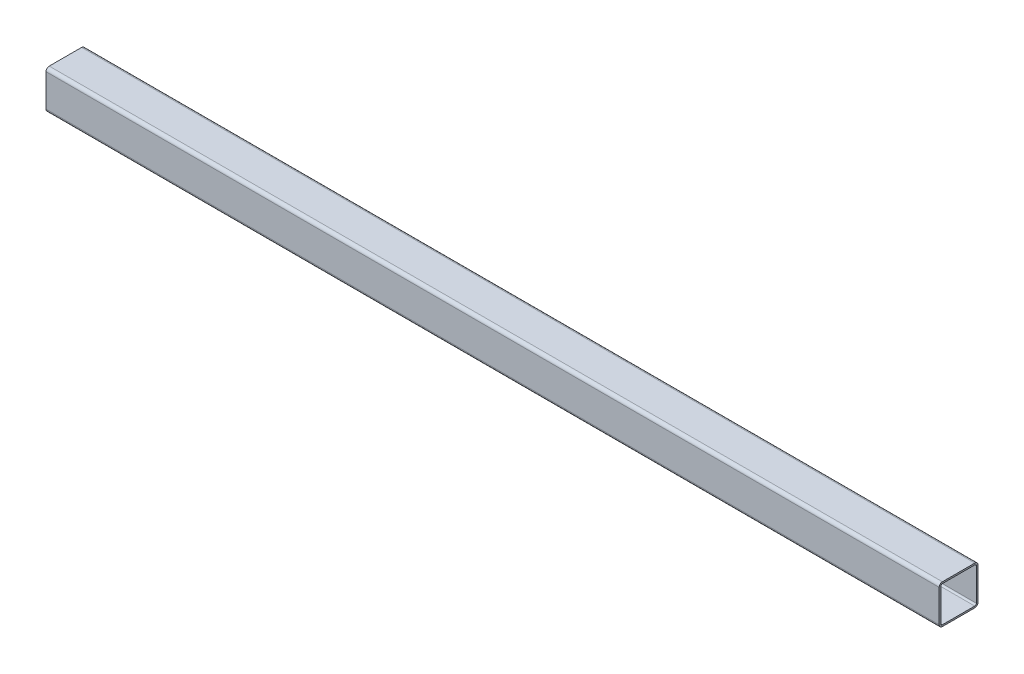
ISO-10303-21;
HEADER;
FILE_DESCRIPTION(('STEP AP214'),'2;1');
FILE_NAME('part.step','',(''),(''),'','','');
FILE_SCHEMA(('AUTOMOTIVE_DESIGN { 1 0 10303 214 1 1 1 1 }'));
ENDSEC;
DATA;
#1=APPLICATION_CONTEXT('core data for automotive mechanical design processes');
#2=APPLICATION_PROTOCOL_DEFINITION('international standard','automotive_design',2000,#1);
#3=PRODUCT_CONTEXT('',#1,'mechanical');
#4=PRODUCT('Part','Part','',(#3));
#5=PRODUCT_RELATED_PRODUCT_CATEGORY('part','',(#4));
#6=PRODUCT_DEFINITION_FORMATION('','',#4);
#7=PRODUCT_DEFINITION_CONTEXT('part definition',#1,'design');
#8=PRODUCT_DEFINITION('design','',#6,#7);
#9=PRODUCT_DEFINITION_SHAPE('','',#8);
#10=(LENGTH_UNIT() NAMED_UNIT(*) SI_UNIT(.MILLI.,.METRE.));
#11=(NAMED_UNIT(*) PLANE_ANGLE_UNIT() SI_UNIT($,.RADIAN.));
#12=(NAMED_UNIT(*) SI_UNIT($,.STERADIAN.) SOLID_ANGLE_UNIT());
#13=UNCERTAINTY_MEASURE_WITH_UNIT(LENGTH_MEASURE(1.E-05),#10,'distance_accuracy_value','');
#14=(GEOMETRIC_REPRESENTATION_CONTEXT(3) GLOBAL_UNCERTAINTY_ASSIGNED_CONTEXT((#13)) GLOBAL_UNIT_ASSIGNED_CONTEXT((#10,
#11,#12)) REPRESENTATION_CONTEXT('',''));
#15=CARTESIAN_POINT('',(0.,0.,0.));
#16=DIRECTION('',(0.,0.,1.));
#17=DIRECTION('',(1.,0.,0.));
#18=AXIS2_PLACEMENT_3D('',#15,#16,#17);
#19=CARTESIAN_POINT('',(0.,63.4999999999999,63.4999999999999));
#20=DIRECTION('',(1.,0.,0.));
#21=DIRECTION('',(0.,0.,-1.));
#22=AXIS2_PLACEMENT_3D('',#19,#20,#21);
#23=PLANE('',#22);
#24=CARTESIAN_POINT('',(0.,63.4999999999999,63.4999999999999));
#25=DIRECTION('',(1.,0.,0.));
#26=DIRECTION('',(0.,0.,-1.));
#27=AXIS2_PLACEMENT_3D('',#24,#25,#26);
#28=CIRCLE('',#27,12.7);
#29=CARTESIAN_POINT('',(0.,76.2,63.4999999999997));
#30=VERTEX_POINT('',#29);
#31=CARTESIAN_POINT('',(0.,63.4999999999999,76.2));
#32=VERTEX_POINT('',#31);
#33=EDGE_CURVE('E185',#30,#32,#28,.T.);
#34=ORIENTED_EDGE('',*,*,#33,.F.);
#35=DIRECTION('',(0.,0.,1.));
#36=VECTOR('',#35,1.);
#37=CARTESIAN_POINT('',(0.,76.2,63.4999999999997));
#38=LINE('',#37,#36);
#39=CARTESIAN_POINT('',(-4.44089209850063E-13,76.2,-63.5000000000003));
#40=VERTEX_POINT('',#39);
#41=EDGE_CURVE('E210',#40,#30,#38,.T.);
#42=ORIENTED_EDGE('',*,*,#41,.F.);
#43=CARTESIAN_POINT('',(-4.44089209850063E-13,63.4999999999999,-63.5000000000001));
#44=DIRECTION('',(1.,0.,0.));
#45=DIRECTION('',(0.,0.,-1.));
#46=AXIS2_PLACEMENT_3D('',#43,#44,#45);
#47=CIRCLE('',#46,12.7);
#48=CARTESIAN_POINT('',(-4.44089209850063E-13,63.4999999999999,-76.2));
#49=VERTEX_POINT('',#48);
#50=EDGE_CURVE('E214',#49,#40,#47,.T.);
#51=ORIENTED_EDGE('',*,*,#50,.F.);
#52=DIRECTION('',(0.,1.,0.));
#53=VECTOR('',#52,1.);
#54=CARTESIAN_POINT('',(-4.44089209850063E-13,-63.4999999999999,-76.2));
#55=LINE('',#54,#53);
#56=CARTESIAN_POINT('',(-4.44089209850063E-13,-63.4999999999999,-76.2));
#57=VERTEX_POINT('',#56);
#58=EDGE_CURVE('E218',#57,#49,#55,.T.);
#59=ORIENTED_EDGE('',*,*,#58,.F.);
#60=CARTESIAN_POINT('',(-4.44089209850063E-13,-63.4999999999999,-63.4999999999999));
#61=DIRECTION('',(1.,0.,0.));
#62=DIRECTION('',(0.,0.,-1.));
#63=AXIS2_PLACEMENT_3D('',#60,#61,#62);
#64=CIRCLE('',#63,12.7);
#65=CARTESIAN_POINT('',(-4.44089209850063E-13,-76.2,-63.4999999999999));
#66=VERTEX_POINT('',#65);
#67=EDGE_CURVE('E222',#66,#57,#64,.T.);
#68=ORIENTED_EDGE('',*,*,#67,.F.);
#69=DIRECTION('',(0.,0.,-1.));
#70=VECTOR('',#69,1.);
#71=CARTESIAN_POINT('',(-4.44089209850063E-13,-76.2,-63.4999999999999));
#72=LINE('',#71,#70);
#73=CARTESIAN_POINT('',(0.,-76.2,63.5000000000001));
#74=VERTEX_POINT('',#73);
#75=EDGE_CURVE('E226',#74,#66,#72,.T.);
#76=ORIENTED_EDGE('',*,*,#75,.F.);
#77=CARTESIAN_POINT('',(0.,-63.4999999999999,63.5000000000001));
#78=DIRECTION('',(1.,0.,0.));
#79=DIRECTION('',(0.,0.,-1.));
#80=AXIS2_PLACEMENT_3D('',#77,#78,#79);
#81=CIRCLE('',#80,12.7);
#82=CARTESIAN_POINT('',(0.,-63.4999999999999,76.2));
#83=VERTEX_POINT('',#82);
#84=EDGE_CURVE('E230',#83,#74,#81,.T.);
#85=ORIENTED_EDGE('',*,*,#84,.F.);
#86=DIRECTION('',(0.,-1.,0.));
#87=VECTOR('',#86,1.);
#88=CARTESIAN_POINT('',(0.,63.4999999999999,76.2));
#89=LINE('',#88,#87);
#90=EDGE_CURVE('E234',#32,#83,#89,.T.);
#91=ORIENTED_EDGE('',*,*,#90,.F.);
#92=EDGE_LOOP('',(#34,#42,#51,#59,#68,#76,#85,#91));
#93=FACE_BOUND('',#92,.T.);
#94=CARTESIAN_POINT('',(0.,63.4999999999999,63.4999999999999));
#95=DIRECTION('',(1.,0.,0.));
#96=DIRECTION('',(0.,0.,-1.));
#97=AXIS2_PLACEMENT_3D('',#94,#95,#96);
#98=CIRCLE('',#97,6.35000000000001);
#99=CARTESIAN_POINT('',(0.,69.8500000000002,63.4999999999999));
#100=VERTEX_POINT('',#99);
#101=CARTESIAN_POINT('',(0.,63.4999999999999,69.85));
#102=VERTEX_POINT('',#101);
#103=EDGE_CURVE('E291',#100,#102,#98,.T.);
#104=ORIENTED_EDGE('',*,*,#103,.T.);
#105=DIRECTION('',(0.,-1.,0.));
#106=VECTOR('',#105,1.);
#107=CARTESIAN_POINT('',(0.,63.4999999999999,69.85));
#108=LINE('',#107,#106);
#109=CARTESIAN_POINT('',(0.,-63.4999999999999,69.85));
#110=VERTEX_POINT('',#109);
#111=EDGE_CURVE('E287',#102,#110,#108,.T.);
#112=ORIENTED_EDGE('',*,*,#111,.T.);
#113=CARTESIAN_POINT('',(0.,-63.4999999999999,63.5000000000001));
#114=DIRECTION('',(1.,0.,0.));
#115=DIRECTION('',(0.,0.,-1.));
#116=AXIS2_PLACEMENT_3D('',#113,#114,#115);
#117=CIRCLE('',#116,6.34999999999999);
#118=CARTESIAN_POINT('',(0.,-69.8499999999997,63.5000000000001));
#119=VERTEX_POINT('',#118);
#120=EDGE_CURVE('E283',#110,#119,#117,.T.);
#121=ORIENTED_EDGE('',*,*,#120,.T.);
#122=DIRECTION('',(0.,0.,-1.));
#123=VECTOR('',#122,1.);
#124=CARTESIAN_POINT('',(-4.44089209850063E-13,-69.8500000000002,-63.4999999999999));
#125=LINE('',#124,#123);
#126=CARTESIAN_POINT('',(-4.44089209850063E-13,-69.8500000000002,-63.4999999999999));
#127=VERTEX_POINT('',#126);
#128=EDGE_CURVE('E279',#119,#127,#125,.T.);
#129=ORIENTED_EDGE('',*,*,#128,.T.);
#130=CARTESIAN_POINT('',(-4.44089209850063E-13,-63.4999999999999,-63.4999999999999));
#131=DIRECTION('',(1.,0.,0.));
#132=DIRECTION('',(0.,0.,-1.));
#133=AXIS2_PLACEMENT_3D('',#130,#131,#132);
#134=CIRCLE('',#133,6.35);
#135=CARTESIAN_POINT('',(-4.44089209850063E-13,-63.4999999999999,-69.85));
#136=VERTEX_POINT('',#135);
#137=EDGE_CURVE('E275',#127,#136,#134,.T.);
#138=ORIENTED_EDGE('',*,*,#137,.T.);
#139=DIRECTION('',(0.,1.,0.));
#140=VECTOR('',#139,1.);
#141=CARTESIAN_POINT('',(-4.44089209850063E-13,-63.4999999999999,-69.85));
#142=LINE('',#141,#140);
#143=CARTESIAN_POINT('',(-4.44089209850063E-13,63.4999999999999,-69.85));
#144=VERTEX_POINT('',#143);
#145=EDGE_CURVE('E271',#136,#144,#142,.T.);
#146=ORIENTED_EDGE('',*,*,#145,.T.);
#147=CARTESIAN_POINT('',(-4.44089209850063E-13,63.4999999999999,-63.5000000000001));
#148=DIRECTION('',(1.,0.,0.));
#149=DIRECTION('',(0.,0.,-1.));
#150=AXIS2_PLACEMENT_3D('',#147,#148,#149);
#151=CIRCLE('',#150,6.34999999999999);
#152=CARTESIAN_POINT('',(-4.44089209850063E-13,69.8500000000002,-63.5000000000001));
#153=VERTEX_POINT('',#152);
#154=EDGE_CURVE('E267',#144,#153,#151,.T.);
#155=ORIENTED_EDGE('',*,*,#154,.T.);
#156=DIRECTION('',(0.,0.,1.));
#157=VECTOR('',#156,1.);
#158=CARTESIAN_POINT('',(0.,69.8500000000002,63.4999999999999));
#159=LINE('',#158,#157);
#160=EDGE_CURVE('E263',#153,#100,#159,.T.);
#161=ORIENTED_EDGE('',*,*,#160,.T.);
#162=EDGE_LOOP('',(#104,#112,#121,#129,#138,#146,#155,#161));
#163=FACE_BOUND('',#162,.T.);
#164=ADVANCED_FACE('F51',(#93,#163),#23,.F.);
#165=CARTESIAN_POINT('',(7315.2,63.4999999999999,63.4999999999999));
#166=DIRECTION('',(-1.,0.,0.));
#167=DIRECTION('',(0.,0.,1.));
#168=AXIS2_PLACEMENT_3D('',#165,#166,#167);
#169=CYLINDRICAL_SURFACE('',#168,12.7);
#170=DIRECTION('',(-1.,0.,0.));
#171=VECTOR('',#170,1.);
#172=CARTESIAN_POINT('',(7315.2,63.4999999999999,76.2));
#173=LINE('',#172,#171);
#174=CARTESIAN_POINT('',(3505.2,63.4999999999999,76.2));
#175=VERTEX_POINT('',#174);
#176=EDGE_CURVE('E60',#175,#32,#173,.T.);
#177=ORIENTED_EDGE('',*,*,#176,.F.);
#178=CARTESIAN_POINT('',(3505.2,63.4999999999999,63.4999999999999));
#179=DIRECTION('',(-1.,0.,0.));
#180=DIRECTION('',(0.,0.,1.));
#181=AXIS2_PLACEMENT_3D('',#178,#179,#180);
#182=CIRCLE('',#181,12.7);
#183=CARTESIAN_POINT('',(3505.2,76.2,63.4999999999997));
#184=VERTEX_POINT('',#183);
#185=EDGE_CURVE('E162',#175,#184,#182,.T.);
#186=ORIENTED_EDGE('',*,*,#185,.T.);
#187=DIRECTION('',(-1.,0.,0.));
#188=VECTOR('',#187,1.);
#189=CARTESIAN_POINT('',(7315.2,76.2,63.4999999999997));
#190=LINE('',#189,#188);
#191=EDGE_CURVE('E207',#184,#30,#190,.T.);
#192=ORIENTED_EDGE('',*,*,#191,.T.);
#193=ORIENTED_EDGE('',*,*,#33,.T.);
#194=EDGE_LOOP('',(#177,#186,#192,#193));
#195=FACE_BOUND('',#194,.T.);
#196=ADVANCED_FACE('F53',(#195),#169,.T.);
#197=CARTESIAN_POINT('',(7315.2,63.4999999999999,76.2));
#198=DIRECTION('',(0.,0.,-1.));
#199=DIRECTION('',(0.,1.,0.));
#200=AXIS2_PLACEMENT_3D('',#197,#198,#199);
#201=PLANE('',#200);
#202=DIRECTION('',(-1.,0.,0.));
#203=VECTOR('',#202,1.);
#204=CARTESIAN_POINT('',(7315.2,-63.4999999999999,76.2));
#205=LINE('',#204,#203);
#206=CARTESIAN_POINT('',(3505.2,-63.5000000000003,76.2));
#207=VERTEX_POINT('',#206);
#208=EDGE_CURVE('E179',#207,#83,#205,.T.);
#209=ORIENTED_EDGE('',*,*,#208,.F.);
#210=DIRECTION('',(0.,-1.,0.));
#211=VECTOR('',#210,1.);
#212=CARTESIAN_POINT('',(3505.2,-1217.93718446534,76.2));
#213=LINE('',#212,#211);
#214=EDGE_CURVE('E165',#175,#207,#213,.T.);
#215=ORIENTED_EDGE('',*,*,#214,.F.);
#216=ORIENTED_EDGE('',*,*,#176,.T.);
#217=ORIENTED_EDGE('',*,*,#90,.T.);
#218=EDGE_LOOP('',(#209,#215,#216,#217));
#219=FACE_BOUND('',#218,.T.);
#220=ADVANCED_FACE('F176',(#219),#201,.F.);
#221=CARTESIAN_POINT('',(7315.2,-63.4999999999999,63.5000000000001));
#222=DIRECTION('',(-1.,0.,0.));
#223=DIRECTION('',(0.,0.,1.));
#224=AXIS2_PLACEMENT_3D('',#221,#222,#223);
#225=CYLINDRICAL_SURFACE('',#224,12.7);
#226=DIRECTION('',(-1.,0.,0.));
#227=VECTOR('',#226,1.);
#228=CARTESIAN_POINT('',(7315.2,-76.2,63.5000000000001));
#229=LINE('',#228,#227);
#230=CARTESIAN_POINT('',(3505.2,-76.2,63.5000000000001));
#231=VERTEX_POINT('',#230);
#232=EDGE_CURVE('E190',#231,#74,#229,.T.);
#233=ORIENTED_EDGE('',*,*,#232,.F.);
#234=CARTESIAN_POINT('',(3505.2,-63.4999999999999,63.5000000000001));
#235=DIRECTION('',(-1.,0.,0.));
#236=DIRECTION('',(0.,0.,1.));
#237=AXIS2_PLACEMENT_3D('',#234,#235,#236);
#238=CIRCLE('',#237,12.7);
#239=EDGE_CURVE('E295',#231,#207,#238,.T.);
#240=ORIENTED_EDGE('',*,*,#239,.T.);
#241=ORIENTED_EDGE('',*,*,#208,.T.);
#242=ORIENTED_EDGE('',*,*,#84,.T.);
#243=EDGE_LOOP('',(#233,#240,#241,#242));
#244=FACE_BOUND('',#243,.T.);
#245=ADVANCED_FACE('F355',(#244),#225,.T.);
#246=CARTESIAN_POINT('',(7315.2,-76.2,-63.4999999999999));
#247=DIRECTION('',(0.,1.,0.));
#248=DIRECTION('',(0.,0.,1.));
#249=AXIS2_PLACEMENT_3D('',#246,#247,#248);
#250=PLANE('',#249);
#251=DIRECTION('',(-1.,0.,0.));
#252=VECTOR('',#251,1.);
#253=CARTESIAN_POINT('',(7315.2,-76.2,-63.4999999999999));
#254=LINE('',#253,#252);
#255=CARTESIAN_POINT('',(3505.2,-76.2,-63.4999999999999));
#256=VERTEX_POINT('',#255);
#257=EDGE_CURVE('E195',#256,#66,#254,.T.);
#258=ORIENTED_EDGE('',*,*,#257,.F.);
#259=DIRECTION('',(0.,0.,1.));
#260=VECTOR('',#259,1.);
#261=CARTESIAN_POINT('',(3505.2,-76.2,-63.4999999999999));
#262=LINE('',#261,#260);
#263=EDGE_CURVE('E298',#256,#231,#262,.T.);
#264=ORIENTED_EDGE('',*,*,#263,.T.);
#265=ORIENTED_EDGE('',*,*,#232,.T.);
#266=ORIENTED_EDGE('',*,*,#75,.T.);
#267=EDGE_LOOP('',(#258,#264,#265,#266));
#268=FACE_BOUND('',#267,.T.);
#269=ADVANCED_FACE('F357',(#268),#250,.F.);
#270=CARTESIAN_POINT('',(7315.2,-63.4999999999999,-63.4999999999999));
#271=DIRECTION('',(-1.,0.,0.));
#272=DIRECTION('',(0.,0.,1.));
#273=AXIS2_PLACEMENT_3D('',#270,#271,#272);
#274=CYLINDRICAL_SURFACE('',#273,12.7);
#275=DIRECTION('',(-1.,0.,0.));
#276=VECTOR('',#275,1.);
#277=CARTESIAN_POINT('',(7315.2,-63.4999999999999,-76.2));
#278=LINE('',#277,#276);
#279=CARTESIAN_POINT('',(3505.2,-63.5000000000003,-76.2));
#280=VERTEX_POINT('',#279);
#281=EDGE_CURVE('E198',#280,#57,#278,.T.);
#282=ORIENTED_EDGE('',*,*,#281,.F.);
#283=CARTESIAN_POINT('',(3505.2,-63.4999999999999,-63.4999999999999));
#284=DIRECTION('',(-1.,0.,0.));
#285=DIRECTION('',(0.,0.,1.));
#286=AXIS2_PLACEMENT_3D('',#283,#284,#285);
#287=CIRCLE('',#286,12.7);
#288=EDGE_CURVE('E172',#280,#256,#287,.T.);
#289=ORIENTED_EDGE('',*,*,#288,.T.);
#290=ORIENTED_EDGE('',*,*,#257,.T.);
#291=ORIENTED_EDGE('',*,*,#67,.T.);
#292=EDGE_LOOP('',(#282,#289,#290,#291));
#293=FACE_BOUND('',#292,.T.);
#294=ADVANCED_FACE('F338',(#293),#274,.T.);
#295=CARTESIAN_POINT('',(7315.2,-63.4999999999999,-76.2));
#296=DIRECTION('',(0.,0.,1.));
#297=DIRECTION('',(1.,0.,0.));
#298=AXIS2_PLACEMENT_3D('',#295,#296,#297);
#299=PLANE('',#298);
#300=DIRECTION('',(-1.,0.,0.));
#301=VECTOR('',#300,1.);
#302=CARTESIAN_POINT('',(7315.2,63.4999999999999,-76.2));
#303=LINE('',#302,#301);
#304=CARTESIAN_POINT('',(3505.2,63.4999999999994,-76.2));
#305=VERTEX_POINT('',#304);
#306=EDGE_CURVE('E201',#305,#49,#303,.T.);
#307=ORIENTED_EDGE('',*,*,#306,.F.);
#308=DIRECTION('',(0.,-1.,0.));
#309=VECTOR('',#308,1.);
#310=CARTESIAN_POINT('',(3505.2,-1217.93718446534,-76.1999999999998));
#311=LINE('',#310,#309);
#312=EDGE_CURVE('E181',#305,#280,#311,.T.);
#313=ORIENTED_EDGE('',*,*,#312,.T.);
#314=ORIENTED_EDGE('',*,*,#281,.T.);
#315=ORIENTED_EDGE('',*,*,#58,.T.);
#316=EDGE_LOOP('',(#307,#313,#314,#315));
#317=FACE_BOUND('',#316,.T.);
#318=ADVANCED_FACE('F336',(#317),#299,.F.);
#319=CARTESIAN_POINT('',(7315.2,63.4999999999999,-63.5000000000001));
#320=DIRECTION('',(-1.,0.,0.));
#321=DIRECTION('',(0.,0.,1.));
#322=AXIS2_PLACEMENT_3D('',#319,#320,#321);
#323=CYLINDRICAL_SURFACE('',#322,12.7);
#324=DIRECTION('',(-1.,0.,0.));
#325=VECTOR('',#324,1.);
#326=CARTESIAN_POINT('',(7315.2,76.2,-63.5000000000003));
#327=LINE('',#326,#325);
#328=CARTESIAN_POINT('',(3505.2,76.2,-63.5000000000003));
#329=VERTEX_POINT('',#328);
#330=EDGE_CURVE('E204',#329,#40,#327,.T.);
#331=ORIENTED_EDGE('',*,*,#330,.F.);
#332=CARTESIAN_POINT('',(3505.2,63.4999999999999,-63.5000000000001));
#333=DIRECTION('',(-1.,0.,0.));
#334=DIRECTION('',(0.,0.,1.));
#335=AXIS2_PLACEMENT_3D('',#332,#333,#334);
#336=CIRCLE('',#335,12.7);
#337=EDGE_CURVE('E67',#329,#305,#336,.T.);
#338=ORIENTED_EDGE('',*,*,#337,.T.);
#339=ORIENTED_EDGE('',*,*,#306,.T.);
#340=ORIENTED_EDGE('',*,*,#50,.T.);
#341=EDGE_LOOP('',(#331,#338,#339,#340));
#342=FACE_BOUND('',#341,.T.);
#343=ADVANCED_FACE('F349',(#342),#323,.T.);
#344=CARTESIAN_POINT('',(7315.2,76.2,63.4999999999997));
#345=DIRECTION('',(0.,-1.,0.));
#346=DIRECTION('',(0.,0.,-1.));
#347=AXIS2_PLACEMENT_3D('',#344,#345,#346);
#348=PLANE('',#347);
#349=ORIENTED_EDGE('',*,*,#191,.F.);
#350=DIRECTION('',(0.,0.,-1.));
#351=VECTOR('',#350,1.);
#352=CARTESIAN_POINT('',(3505.2,76.2,63.4999999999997));
#353=LINE('',#352,#351);
#354=EDGE_CURVE('E167',#184,#329,#353,.T.);
#355=ORIENTED_EDGE('',*,*,#354,.T.);
#356=ORIENTED_EDGE('',*,*,#330,.T.);
#357=ORIENTED_EDGE('',*,*,#41,.T.);
#358=EDGE_LOOP('',(#349,#355,#356,#357));
#359=FACE_BOUND('',#358,.T.);
#360=ADVANCED_FACE('F351',(#359),#348,.F.);
#361=CARTESIAN_POINT('',(7315.2,63.4999999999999,63.4999999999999));
#362=DIRECTION('',(-1.,0.,0.));
#363=DIRECTION('',(0.,0.,1.));
#364=AXIS2_PLACEMENT_3D('',#361,#362,#363);
#365=CYLINDRICAL_SURFACE('',#364,6.35000000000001);
#366=CARTESIAN_POINT('',(3505.2,63.4999999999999,63.4999999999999));
#367=DIRECTION('',(-1.,0.,0.));
#368=DIRECTION('',(0.,0.,1.));
#369=AXIS2_PLACEMENT_3D('',#366,#367,#368);
#370=CIRCLE('',#369,6.35000000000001);
#371=CARTESIAN_POINT('',(3505.2,63.4999999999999,69.85));
#372=VERTEX_POINT('',#371);
#373=CARTESIAN_POINT('',(3505.2,69.8500000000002,63.4999999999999));
#374=VERTEX_POINT('',#373);
#375=EDGE_CURVE('E74',#372,#374,#370,.T.);
#376=ORIENTED_EDGE('',*,*,#375,.F.);
#377=DIRECTION('',(-1.,0.,0.));
#378=VECTOR('',#377,1.);
#379=CARTESIAN_POINT('',(7315.2,63.4999999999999,69.85));
#380=LINE('',#379,#378);
#381=EDGE_CURVE('E239',#372,#102,#380,.T.);
#382=ORIENTED_EDGE('',*,*,#381,.T.);
#383=ORIENTED_EDGE('',*,*,#103,.F.);
#384=DIRECTION('',(-1.,0.,0.));
#385=VECTOR('',#384,1.);
#386=CARTESIAN_POINT('',(7315.2,69.8500000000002,63.4999999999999));
#387=LINE('',#386,#385);
#388=EDGE_CURVE('E260',#374,#100,#387,.T.);
#389=ORIENTED_EDGE('',*,*,#388,.F.);
#390=EDGE_LOOP('',(#376,#382,#383,#389));
#391=FACE_BOUND('',#390,.T.);
#392=ADVANCED_FACE('F375',(#391),#365,.F.);
#393=CARTESIAN_POINT('',(7315.2,63.4999999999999,69.85));
#394=DIRECTION('',(0.,0.,-1.));
#395=DIRECTION('',(0.,1.,0.));
#396=AXIS2_PLACEMENT_3D('',#393,#394,#395);
#397=PLANE('',#396);
#398=DIRECTION('',(0.,1.,0.));
#399=VECTOR('',#398,1.);
#400=CARTESIAN_POINT('',(3505.2,63.4999999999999,69.85));
#401=LINE('',#400,#399);
#402=CARTESIAN_POINT('',(3505.2,-63.4999999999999,69.85));
#403=VERTEX_POINT('',#402);
#404=EDGE_CURVE('E311',#403,#372,#401,.T.);
#405=ORIENTED_EDGE('',*,*,#404,.F.);
#406=DIRECTION('',(-1.,0.,0.));
#407=VECTOR('',#406,1.);
#408=CARTESIAN_POINT('',(7315.2,-63.4999999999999,69.85));
#409=LINE('',#408,#407);
#410=EDGE_CURVE('E242',#403,#110,#409,.T.);
#411=ORIENTED_EDGE('',*,*,#410,.T.);
#412=ORIENTED_EDGE('',*,*,#111,.F.);
#413=ORIENTED_EDGE('',*,*,#381,.F.);
#414=EDGE_LOOP('',(#405,#411,#412,#413));
#415=FACE_BOUND('',#414,.T.);
#416=ADVANCED_FACE('F404',(#415),#397,.T.);
#417=CARTESIAN_POINT('',(7315.2,-63.4999999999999,63.5000000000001));
#418=DIRECTION('',(-1.,0.,0.));
#419=DIRECTION('',(0.,0.,1.));
#420=AXIS2_PLACEMENT_3D('',#417,#418,#419);
#421=CYLINDRICAL_SURFACE('',#420,6.34999999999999);
#422=CARTESIAN_POINT('',(3505.2,-63.4999999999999,63.5000000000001));
#423=DIRECTION('',(-1.,0.,0.));
#424=DIRECTION('',(0.,0.,1.));
#425=AXIS2_PLACEMENT_3D('',#422,#423,#424);
#426=CIRCLE('',#425,6.34999999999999);
#427=CARTESIAN_POINT('',(3505.2,-69.8499999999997,63.5000000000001));
#428=VERTEX_POINT('',#427);
#429=EDGE_CURVE('E314',#428,#403,#426,.T.);
#430=ORIENTED_EDGE('',*,*,#429,.F.);
#431=DIRECTION('',(-1.,0.,0.));
#432=VECTOR('',#431,1.);
#433=CARTESIAN_POINT('',(7315.2,-69.8499999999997,63.5000000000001));
#434=LINE('',#433,#432);
#435=EDGE_CURVE('E245',#428,#119,#434,.T.);
#436=ORIENTED_EDGE('',*,*,#435,.T.);
#437=ORIENTED_EDGE('',*,*,#120,.F.);
#438=ORIENTED_EDGE('',*,*,#410,.F.);
#439=EDGE_LOOP('',(#430,#436,#437,#438));
#440=FACE_BOUND('',#439,.T.);
#441=ADVANCED_FACE('F411',(#440),#421,.F.);
#442=CARTESIAN_POINT('',(7315.2,-69.8500000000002,-63.4999999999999));
#443=DIRECTION('',(0.,1.,0.));
#444=DIRECTION('',(0.,0.,1.));
#445=AXIS2_PLACEMENT_3D('',#442,#443,#444);
#446=PLANE('',#445);
#447=DIRECTION('',(0.,0.,1.));
#448=VECTOR('',#447,1.);
#449=CARTESIAN_POINT('',(3505.2,-69.8500000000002,-63.4999999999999));
#450=LINE('',#449,#448);
#451=CARTESIAN_POINT('',(3505.2,-69.8500000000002,-63.4999999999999));
#452=VERTEX_POINT('',#451);
#453=EDGE_CURVE('E317',#452,#428,#450,.T.);
#454=ORIENTED_EDGE('',*,*,#453,.F.);
#455=DIRECTION('',(-1.,0.,0.));
#456=VECTOR('',#455,1.);
#457=CARTESIAN_POINT('',(7315.2,-69.8500000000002,-63.4999999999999));
#458=LINE('',#457,#456);
#459=EDGE_CURVE('E248',#452,#127,#458,.T.);
#460=ORIENTED_EDGE('',*,*,#459,.T.);
#461=ORIENTED_EDGE('',*,*,#128,.F.);
#462=ORIENTED_EDGE('',*,*,#435,.F.);
#463=EDGE_LOOP('',(#454,#460,#461,#462));
#464=FACE_BOUND('',#463,.T.);
#465=ADVANCED_FACE('F418',(#464),#446,.T.);
#466=CARTESIAN_POINT('',(7315.2,-63.4999999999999,-63.4999999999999));
#467=DIRECTION('',(-1.,0.,0.));
#468=DIRECTION('',(0.,0.,1.));
#469=AXIS2_PLACEMENT_3D('',#466,#467,#468);
#470=CYLINDRICAL_SURFACE('',#469,6.35);
#471=CARTESIAN_POINT('',(3505.2,-63.4999999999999,-63.4999999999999));
#472=DIRECTION('',(-1.,0.,0.));
#473=DIRECTION('',(0.,0.,1.));
#474=AXIS2_PLACEMENT_3D('',#471,#472,#473);
#475=CIRCLE('',#474,6.35);
#476=CARTESIAN_POINT('',(3505.2,-63.4999999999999,-69.85));
#477=VERTEX_POINT('',#476);
#478=EDGE_CURVE('E320',#477,#452,#475,.T.);
#479=ORIENTED_EDGE('',*,*,#478,.F.);
#480=DIRECTION('',(-1.,0.,0.));
#481=VECTOR('',#480,1.);
#482=CARTESIAN_POINT('',(7315.2,-63.4999999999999,-69.85));
#483=LINE('',#482,#481);
#484=EDGE_CURVE('E251',#477,#136,#483,.T.);
#485=ORIENTED_EDGE('',*,*,#484,.T.);
#486=ORIENTED_EDGE('',*,*,#137,.F.);
#487=ORIENTED_EDGE('',*,*,#459,.F.);
#488=EDGE_LOOP('',(#479,#485,#486,#487));
#489=FACE_BOUND('',#488,.T.);
#490=ADVANCED_FACE('F426',(#489),#470,.F.);
#491=CARTESIAN_POINT('',(7315.2,-63.4999999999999,-69.85));
#492=DIRECTION('',(0.,0.,1.));
#493=DIRECTION('',(0.,-1.,0.));
#494=AXIS2_PLACEMENT_3D('',#491,#492,#493);
#495=PLANE('',#494);
#496=DIRECTION('',(0.,-1.,0.));
#497=VECTOR('',#496,1.);
#498=CARTESIAN_POINT('',(3505.2,-63.4999999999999,-69.85));
#499=LINE('',#498,#497);
#500=CARTESIAN_POINT('',(3505.2,63.4999999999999,-69.85));
#501=VERTEX_POINT('',#500);
#502=EDGE_CURVE('E323',#501,#477,#499,.T.);
#503=ORIENTED_EDGE('',*,*,#502,.F.);
#504=DIRECTION('',(-1.,0.,0.));
#505=VECTOR('',#504,1.);
#506=CARTESIAN_POINT('',(7315.2,63.4999999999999,-69.85));
#507=LINE('',#506,#505);
#508=EDGE_CURVE('E254',#501,#144,#507,.T.);
#509=ORIENTED_EDGE('',*,*,#508,.T.);
#510=ORIENTED_EDGE('',*,*,#145,.F.);
#511=ORIENTED_EDGE('',*,*,#484,.F.);
#512=EDGE_LOOP('',(#503,#509,#510,#511));
#513=FACE_BOUND('',#512,.T.);
#514=ADVANCED_FACE('F434',(#513),#495,.T.);
#515=CARTESIAN_POINT('',(7315.2,63.4999999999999,-63.5000000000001));
#516=DIRECTION('',(-1.,0.,0.));
#517=DIRECTION('',(0.,0.,1.));
#518=AXIS2_PLACEMENT_3D('',#515,#516,#517);
#519=CYLINDRICAL_SURFACE('',#518,6.34999999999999);
#520=CARTESIAN_POINT('',(3505.2,63.4999999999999,-63.5000000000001));
#521=DIRECTION('',(-1.,0.,0.));
#522=DIRECTION('',(0.,0.,1.));
#523=AXIS2_PLACEMENT_3D('',#520,#521,#522);
#524=CIRCLE('',#523,6.34999999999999);
#525=CARTESIAN_POINT('',(3505.2,69.8500000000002,-63.5000000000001));
#526=VERTEX_POINT('',#525);
#527=EDGE_CURVE('E326',#526,#501,#524,.T.);
#528=ORIENTED_EDGE('',*,*,#527,.F.);
#529=DIRECTION('',(-1.,0.,0.));
#530=VECTOR('',#529,1.);
#531=CARTESIAN_POINT('',(7315.2,69.8500000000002,-63.4999999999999));
#532=LINE('',#531,#530);
#533=EDGE_CURVE('E257',#526,#153,#532,.T.);
#534=ORIENTED_EDGE('',*,*,#533,.T.);
#535=ORIENTED_EDGE('',*,*,#154,.F.);
#536=ORIENTED_EDGE('',*,*,#508,.F.);
#537=EDGE_LOOP('',(#528,#534,#535,#536));
#538=FACE_BOUND('',#537,.T.);
#539=ADVANCED_FACE('F442',(#538),#519,.F.);
#540=CARTESIAN_POINT('',(7315.2,69.8500000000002,63.4999999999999));
#541=DIRECTION('',(0.,-1.,0.));
#542=DIRECTION('',(0.,0.,-1.));
#543=AXIS2_PLACEMENT_3D('',#540,#541,#542);
#544=PLANE('',#543);
#545=DIRECTION('',(0.,0.,-1.));
#546=VECTOR('',#545,1.);
#547=CARTESIAN_POINT('',(3505.2,69.8500000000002,63.4999999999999));
#548=LINE('',#547,#546);
#549=EDGE_CURVE('E11',#374,#526,#548,.T.);
#550=ORIENTED_EDGE('',*,*,#549,.F.);
#551=ORIENTED_EDGE('',*,*,#388,.T.);
#552=ORIENTED_EDGE('',*,*,#160,.F.);
#553=ORIENTED_EDGE('',*,*,#533,.F.);
#554=EDGE_LOOP('',(#550,#551,#552,#553));
#555=FACE_BOUND('',#554,.T.);
#556=ADVANCED_FACE('F450',(#555),#544,.T.);
#557=CARTESIAN_POINT('',(3505.2,-1217.93718446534,-76.1999999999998));
#558=DIRECTION('',(-1.,0.,0.));
#559=DIRECTION('',(0.,0.,1.));
#560=AXIS2_PLACEMENT_3D('',#557,#558,#559);
#561=PLANE('',#560);
#562=ORIENTED_EDGE('',*,*,#375,.T.);
#563=ORIENTED_EDGE('',*,*,#549,.T.);
#564=ORIENTED_EDGE('',*,*,#527,.T.);
#565=ORIENTED_EDGE('',*,*,#502,.T.);
#566=ORIENTED_EDGE('',*,*,#478,.T.);
#567=ORIENTED_EDGE('',*,*,#453,.T.);
#568=ORIENTED_EDGE('',*,*,#429,.T.);
#569=ORIENTED_EDGE('',*,*,#404,.T.);
#570=EDGE_LOOP('',(#562,#563,#564,#565,#566,#567,#568,#569));
#571=FACE_BOUND('',#570,.T.);
#572=ORIENTED_EDGE('',*,*,#263,.F.);
#573=ORIENTED_EDGE('',*,*,#288,.F.);
#574=ORIENTED_EDGE('',*,*,#312,.F.);
#575=ORIENTED_EDGE('',*,*,#337,.F.);
#576=ORIENTED_EDGE('',*,*,#354,.F.);
#577=ORIENTED_EDGE('',*,*,#185,.F.);
#578=ORIENTED_EDGE('',*,*,#214,.T.);
#579=ORIENTED_EDGE('',*,*,#239,.F.);
#580=EDGE_LOOP('',(#572,#573,#574,#575,#576,#577,#578,#579));
#581=FACE_BOUND('',#580,.T.);
#582=ADVANCED_FACE('F164',(#571,#581),#561,.F.);
#583=CLOSED_SHELL('',(#164,#196,#220,#245,#269,#294,#318,#343,#360,#392,#416,#441,#465,#490,
#514,#539,#556,#582));
#584=MANIFOLD_SOLID_BREP('B2',#583);
#585=ADVANCED_BREP_SHAPE_REPRESENTATION('',(#18,#584),#14);
#586=SHAPE_DEFINITION_REPRESENTATION(#9,#585);
ENDSEC;
END-ISO-10303-21;
